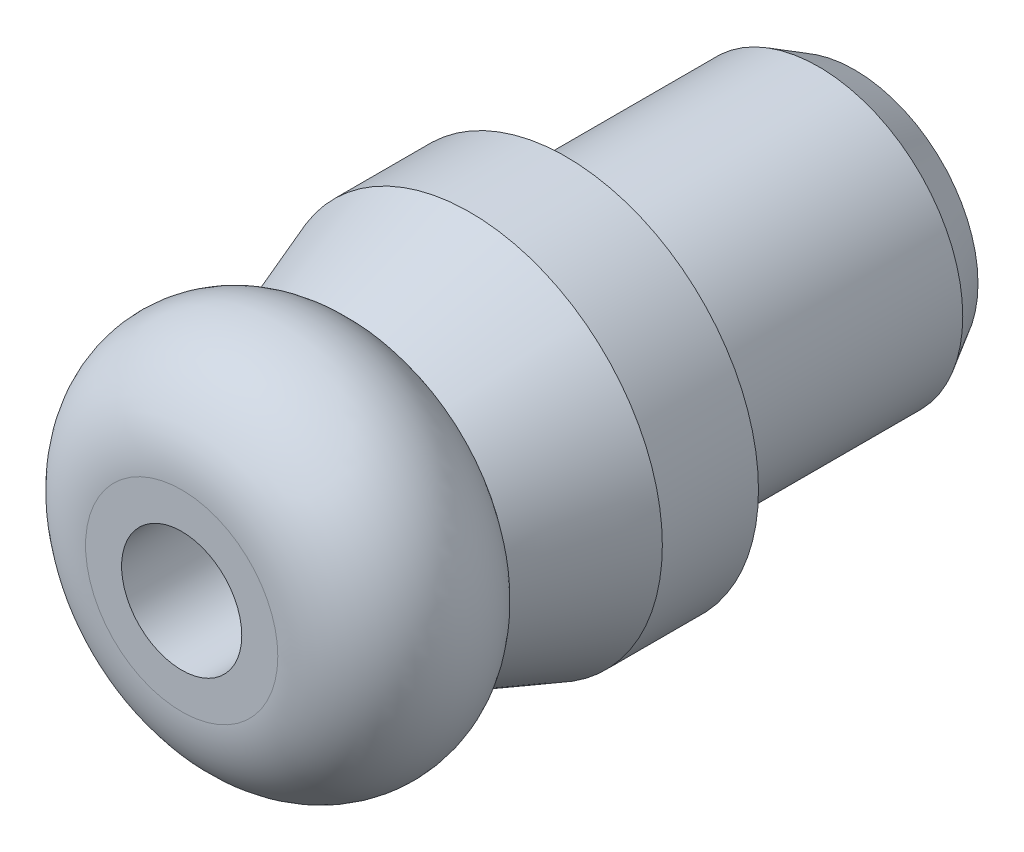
ISO-10303-21;
HEADER;
FILE_DESCRIPTION(('STEP AP214'),'2;1');
FILE_NAME('part.step','',(''),(''),'','','');
FILE_SCHEMA(('AUTOMOTIVE_DESIGN { 1 0 10303 214 1 1 1 1 }'));
ENDSEC;
DATA;
#1=APPLICATION_CONTEXT('core data for automotive mechanical design processes');
#2=APPLICATION_PROTOCOL_DEFINITION('international standard','automotive_design',2000,#1);
#3=PRODUCT_CONTEXT('',#1,'mechanical');
#4=PRODUCT('Part','Part','',(#3));
#5=PRODUCT_RELATED_PRODUCT_CATEGORY('part','',(#4));
#6=PRODUCT_DEFINITION_FORMATION('','',#4);
#7=PRODUCT_DEFINITION_CONTEXT('part definition',#1,'design');
#8=PRODUCT_DEFINITION('design','',#6,#7);
#9=PRODUCT_DEFINITION_SHAPE('','',#8);
#10=(LENGTH_UNIT() NAMED_UNIT(*) SI_UNIT(.MILLI.,.METRE.));
#11=(NAMED_UNIT(*) PLANE_ANGLE_UNIT() SI_UNIT($,.RADIAN.));
#12=(NAMED_UNIT(*) SI_UNIT($,.STERADIAN.) SOLID_ANGLE_UNIT());
#13=UNCERTAINTY_MEASURE_WITH_UNIT(LENGTH_MEASURE(1.E-05),#10,'distance_accuracy_value','');
#14=(GEOMETRIC_REPRESENTATION_CONTEXT(3) GLOBAL_UNCERTAINTY_ASSIGNED_CONTEXT((#13)) GLOBAL_UNIT_ASSIGNED_CONTEXT((#10,
#11,#12)) REPRESENTATION_CONTEXT('',''));
#15=CARTESIAN_POINT('',(0.,0.,0.));
#16=DIRECTION('',(0.,0.,1.));
#17=DIRECTION('',(1.,0.,0.));
#18=AXIS2_PLACEMENT_3D('',#15,#16,#17);
#19=CARTESIAN_POINT('',(0.,2.5,6.));
#20=DIRECTION('',(0.,0.,1.));
#21=DIRECTION('',(1.,0.,0.));
#22=AXIS2_PLACEMENT_3D('',#19,#20,#21);
#23=PLANE('',#22);
#24=CARTESIAN_POINT('',(0.,0.,6.));
#25=DIRECTION('',(0.,0.,1.));
#26=DIRECTION('',(1.,0.,0.));
#27=AXIS2_PLACEMENT_3D('',#24,#25,#26);
#28=CIRCLE('',#27,2.5);
#29=CARTESIAN_POINT('',(2.5,0.,6.));
#30=VERTEX_POINT('',#29);
#31=EDGE_CURVE('E8',#30,#30,#28,.T.);
#32=ORIENTED_EDGE('',*,*,#31,.T.);
#33=EDGE_LOOP('',(#32));
#34=FACE_BOUND('',#33,.T.);
#35=ADVANCED_FACE('F12',(#34),#23,.T.);
#36=CARTESIAN_POINT('',(0.,0.,33.2661837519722));
#37=DIRECTION('',(0.,0.,1.));
#38=DIRECTION('',(1.,0.,0.));
#39=AXIS2_PLACEMENT_3D('',#36,#37,#38);
#40=CYLINDRICAL_SURFACE('',#39,2.5);
#41=CARTESIAN_POINT('',(0.,0.,16.));
#42=DIRECTION('',(0.,0.,1.));
#43=DIRECTION('',(1.,0.,0.));
#44=AXIS2_PLACEMENT_3D('',#41,#42,#43);
#45=CIRCLE('',#44,2.5);
#46=CARTESIAN_POINT('',(2.5,0.,16.));
#47=VERTEX_POINT('',#46);
#48=EDGE_CURVE('E18',#47,#47,#45,.T.);
#49=ORIENTED_EDGE('',*,*,#48,.T.);
#50=EDGE_LOOP('',(#49));
#51=FACE_BOUND('',#50,.T.);
#52=ORIENTED_EDGE('',*,*,#31,.F.);
#53=EDGE_LOOP('',(#52));
#54=FACE_BOUND('',#53,.T.);
#55=ADVANCED_FACE('F60',(#51,#54),#40,.F.);
#56=CARTESIAN_POINT('',(0.,4.,15.999999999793));
#57=DIRECTION('',(0.,0.,1.));
#58=DIRECTION('',(1.,0.,0.));
#59=AXIS2_PLACEMENT_3D('',#56,#57,#58);
#60=PLANE('',#59);
#61=CARTESIAN_POINT('',(0.,0.,15.9999999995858));
#62=DIRECTION('',(0.,0.,1.));
#63=DIRECTION('',(1.,0.,0.));
#64=AXIS2_PLACEMENT_3D('',#61,#62,#63);
#65=CIRCLE('',#64,4.);
#66=CARTESIAN_POINT('',(4.,0.,15.9999999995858));
#67=VERTEX_POINT('',#66);
#68=EDGE_CURVE('E22',#67,#67,#65,.T.);
#69=ORIENTED_EDGE('',*,*,#68,.T.);
#70=EDGE_LOOP('',(#69));
#71=FACE_BOUND('',#70,.T.);
#72=ORIENTED_EDGE('',*,*,#48,.F.);
#73=EDGE_LOOP('',(#72));
#74=FACE_BOUND('',#73,.T.);
#75=ADVANCED_FACE('F64',(#71,#74),#60,.T.);
#76=CARTESIAN_POINT('',(0.,0.,11.9999999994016));
#77=DIRECTION('',(0.,0.,1.));
#78=DIRECTION('',(1.,0.,0.));
#79=AXIS2_PLACEMENT_3D('',#76,#77,#78);
#80=DEGENERATE_TOROIDAL_SURFACE('',#79,4.,4.00000000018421,.T.);
#81=CARTESIAN_POINT('',(0.,0.,8.71589099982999));
#82=DIRECTION('',(0.,0.,1.));
#83=DIRECTION('',(1.,0.,0.));
#84=AXIS2_PLACEMENT_3D('',#81,#82,#83);
#85=CIRCLE('',#84,6.28355601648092);
#86=CARTESIAN_POINT('',(6.28355601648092,0.,8.71589099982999));
#87=VERTEX_POINT('',#86);
#88=EDGE_CURVE('E26',#87,#87,#85,.T.);
#89=ORIENTED_EDGE('',*,*,#88,.T.);
#90=EDGE_LOOP('',(#89));
#91=FACE_BOUND('',#90,.T.);
#92=ORIENTED_EDGE('',*,*,#68,.F.);
#93=EDGE_LOOP('',(#92));
#94=FACE_BOUND('',#93,.T.);
#95=ADVANCED_FACE('F68',(#91,#94),#80,.T.);
#96=CARTESIAN_POINT('',(0.,0.,8.71589099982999));
#97=DIRECTION('',(0.,0.,-1.));
#98=DIRECTION('',(-1.,0.,0.));
#99=AXIS2_PLACEMENT_3D('',#96,#97,#98);
#100=CONICAL_SURFACE('',#99,6.28355601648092,0.349065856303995);
#101=CARTESIAN_POINT('',(0.,0.,4.));
#102=DIRECTION('',(0.,0.,1.));
#103=DIRECTION('',(1.,0.,0.));
#104=AXIS2_PLACEMENT_3D('',#101,#102,#103);
#105=CIRCLE('',#104,8.);
#106=CARTESIAN_POINT('',(8.,0.,4.));
#107=VERTEX_POINT('',#106);
#108=EDGE_CURVE('E31',#107,#107,#105,.T.);
#109=ORIENTED_EDGE('',*,*,#108,.T.);
#110=EDGE_LOOP('',(#109));
#111=FACE_BOUND('',#110,.T.);
#112=ORIENTED_EDGE('',*,*,#88,.F.);
#113=EDGE_LOOP('',(#112));
#114=FACE_BOUND('',#113,.T.);
#115=ADVANCED_FACE('F75',(#111,#114),#100,.T.);
#116=CARTESIAN_POINT('',(0.,0.,33.2661837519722));
#117=DIRECTION('',(0.,0.,1.));
#118=DIRECTION('',(1.,0.,0.));
#119=AXIS2_PLACEMENT_3D('',#116,#117,#118);
#120=CYLINDRICAL_SURFACE('',#119,8.);
#121=CARTESIAN_POINT('',(0.,0.,0.));
#122=DIRECTION('',(0.,0.,1.));
#123=DIRECTION('',(1.,0.,0.));
#124=AXIS2_PLACEMENT_3D('',#121,#122,#123);
#125=CIRCLE('',#124,8.);
#126=CARTESIAN_POINT('',(8.,0.,0.));
#127=VERTEX_POINT('',#126);
#128=EDGE_CURVE('E34',#127,#127,#125,.T.);
#129=ORIENTED_EDGE('',*,*,#128,.T.);
#130=EDGE_LOOP('',(#129));
#131=FACE_BOUND('',#130,.T.);
#132=ORIENTED_EDGE('',*,*,#108,.F.);
#133=EDGE_LOOP('',(#132));
#134=FACE_BOUND('',#133,.T.);
#135=ADVANCED_FACE('F79',(#131,#134),#120,.T.);
#136=CARTESIAN_POINT('',(0.,6.,0.));
#137=DIRECTION('',(0.,0.,-1.));
#138=DIRECTION('',(-1.,0.,0.));
#139=AXIS2_PLACEMENT_3D('',#136,#137,#138);
#140=PLANE('',#139);
#141=CARTESIAN_POINT('',(0.,0.,0.));
#142=DIRECTION('',(0.,0.,1.));
#143=DIRECTION('',(1.,0.,0.));
#144=AXIS2_PLACEMENT_3D('',#141,#142,#143);
#145=CIRCLE('',#144,6.);
#146=CARTESIAN_POINT('',(6.,0.,0.));
#147=VERTEX_POINT('',#146);
#148=EDGE_CURVE('E37',#147,#147,#145,.T.);
#149=ORIENTED_EDGE('',*,*,#148,.T.);
#150=EDGE_LOOP('',(#149));
#151=FACE_BOUND('',#150,.T.);
#152=ORIENTED_EDGE('',*,*,#128,.F.);
#153=EDGE_LOOP('',(#152));
#154=FACE_BOUND('',#153,.T.);
#155=ADVANCED_FACE('F83',(#151,#154),#140,.T.);
#156=CARTESIAN_POINT('',(0.,0.,33.2661837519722));
#157=DIRECTION('',(0.,0.,1.));
#158=DIRECTION('',(1.,0.,0.));
#159=AXIS2_PLACEMENT_3D('',#156,#157,#158);
#160=CYLINDRICAL_SURFACE('',#159,6.);
#161=CARTESIAN_POINT('',(0.,0.,-10.5));
#162=DIRECTION('',(0.,0.,1.));
#163=DIRECTION('',(1.,0.,0.));
#164=AXIS2_PLACEMENT_3D('',#161,#162,#163);
#165=CIRCLE('',#164,6.);
#166=CARTESIAN_POINT('',(6.,0.,-10.5));
#167=VERTEX_POINT('',#166);
#168=EDGE_CURVE('E40',#167,#167,#165,.T.);
#169=ORIENTED_EDGE('',*,*,#168,.T.);
#170=EDGE_LOOP('',(#169));
#171=FACE_BOUND('',#170,.T.);
#172=ORIENTED_EDGE('',*,*,#148,.F.);
#173=EDGE_LOOP('',(#172));
#174=FACE_BOUND('',#173,.T.);
#175=ADVANCED_FACE('F57',(#171,#174),#160,.T.);
#176=CARTESIAN_POINT('',(0.,0.,-10.5));
#177=DIRECTION('',(0.,0.,1.));
#178=DIRECTION('',(1.,0.,0.));
#179=AXIS2_PLACEMENT_3D('',#176,#177,#178);
#180=CONICAL_SURFACE('',#179,6.,0.523598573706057);
#181=CARTESIAN_POINT('',(0.,0.,-12.));
#182=DIRECTION('',(0.,0.,1.));
#183=DIRECTION('',(1.,0.,0.));
#184=AXIS2_PLACEMENT_3D('',#181,#182,#183);
#185=CIRCLE('',#184,5.133975);
#186=CARTESIAN_POINT('',(5.133975,0.,-12.));
#187=VERTEX_POINT('',#186);
#188=EDGE_CURVE('E43',#187,#187,#185,.T.);
#189=ORIENTED_EDGE('',*,*,#188,.T.);
#190=EDGE_LOOP('',(#189));
#191=FACE_BOUND('',#190,.T.);
#192=ORIENTED_EDGE('',*,*,#168,.F.);
#193=EDGE_LOOP('',(#192));
#194=FACE_BOUND('',#193,.T.);
#195=ADVANCED_FACE('F47',(#191,#194),#180,.T.);
#196=CARTESIAN_POINT('',(0.,0.,-12.));
#197=DIRECTION('',(0.,0.,-1.));
#198=DIRECTION('',(-1.,0.,0.));
#199=AXIS2_PLACEMENT_3D('',#196,#197,#198);
#200=PLANE('',#199);
#201=ORIENTED_EDGE('',*,*,#188,.F.);
#202=EDGE_LOOP('',(#201));
#203=FACE_BOUND('',#202,.T.);
#204=ADVANCED_FACE('F50',(#203),#200,.T.);
#205=CLOSED_SHELL('',(#35,#55,#75,#95,#115,#135,#155,#175,#195,#204));
#206=MANIFOLD_SOLID_BREP('B1',#205);
#207=ADVANCED_BREP_SHAPE_REPRESENTATION('',(#18,#206),#14);
#208=SHAPE_DEFINITION_REPRESENTATION(#9,#207);
ENDSEC;
END-ISO-10303-21;
